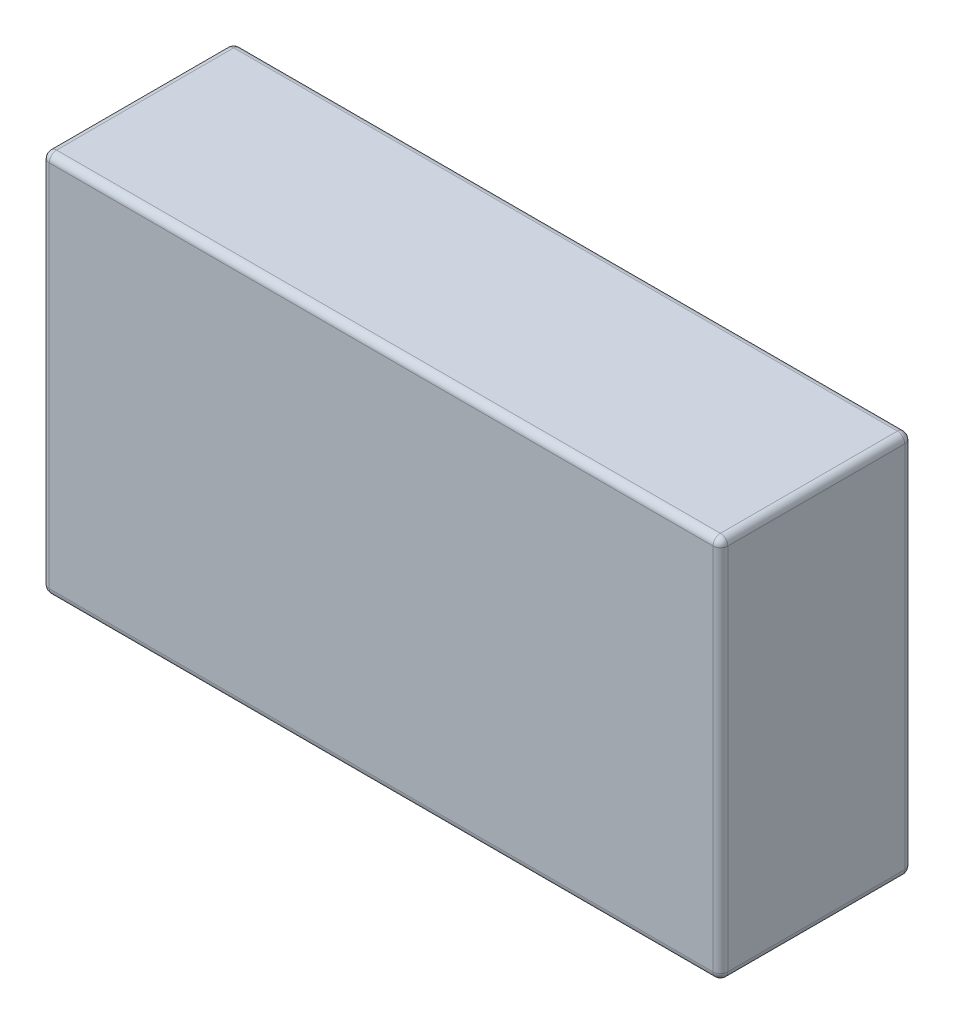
from build123d import *

# Parameters (mm, degrees)
CROQUIS1_W              = 46
CROQUIS1_H              = 26
SALIENTE_EXTRUIR1_DEPTH = 13
REDONDEO1_R             = 0.5


with BuildPart() as part:
    # Croquis1 → Saliente-Extruir1 (new body)
    with BuildSketch(Plane.XY):
        with Locations((23, 13)):
            Rectangle(CROQUIS1_W, CROQUIS1_H)
    extrude(amount=SALIENTE_EXTRUIR1_DEPTH)

    # Redondeo1
    redondeo1_edges = [part.edges().sort_by_distance(p)[0] for p in [
        (46, 13, 13),
        (23, 26, 13),
        (0, 13, 13),
        (23, 26, 0),
        (46, 13, 0),
        (23, 0, 0),
        (0, 13, 0),
        (0, 26, 6.5),
        (46, 26, 6.5),
        (46, 0, 6.5),
        (0, 0, 6.5),
        (23, 0, 13),
    ]]
    fillet(redondeo1_edges, radius=REDONDEO1_R)


solid = part.part
